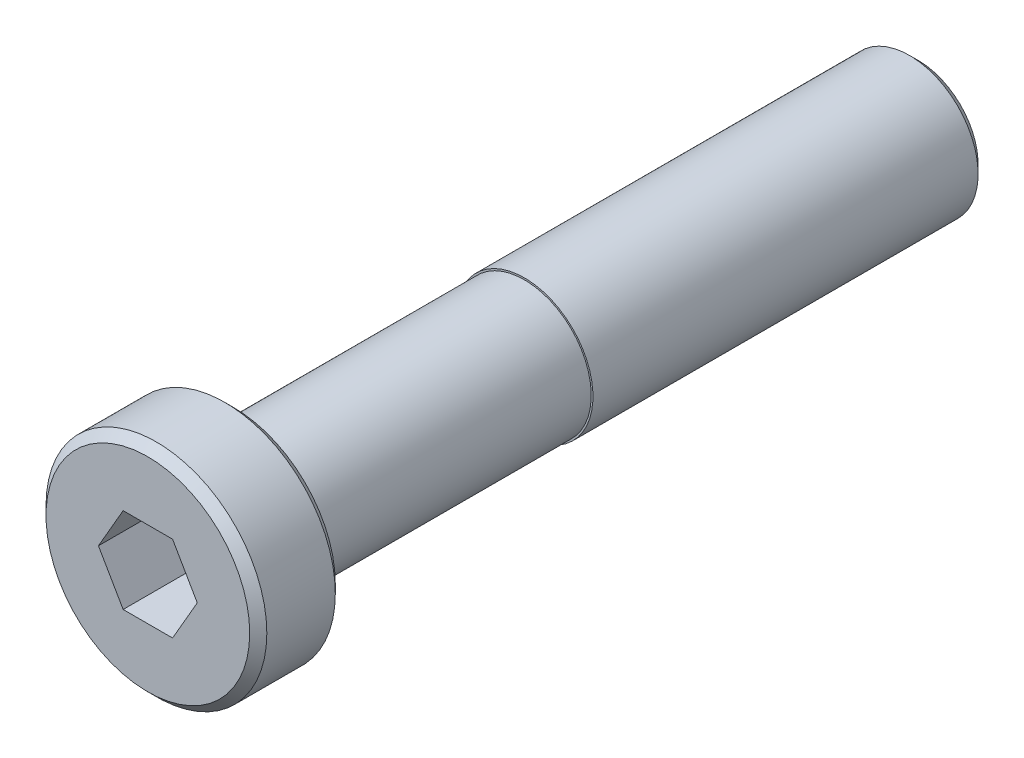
ISO-10303-21;
HEADER;
FILE_DESCRIPTION(('STEP AP214'),'2;1');
FILE_NAME('part.step','',(''),(''),'','','');
FILE_SCHEMA(('AUTOMOTIVE_DESIGN { 1 0 10303 214 1 1 1 1 }'));
ENDSEC;
DATA;
#1=APPLICATION_CONTEXT('core data for automotive mechanical design processes');
#2=APPLICATION_PROTOCOL_DEFINITION('international standard','automotive_design',2000,#1);
#3=PRODUCT_CONTEXT('',#1,'mechanical');
#4=PRODUCT('Part','Part','',(#3));
#5=PRODUCT_RELATED_PRODUCT_CATEGORY('part','',(#4));
#6=PRODUCT_DEFINITION_FORMATION('','',#4);
#7=PRODUCT_DEFINITION_CONTEXT('part definition',#1,'design');
#8=PRODUCT_DEFINITION('design','',#6,#7);
#9=PRODUCT_DEFINITION_SHAPE('','',#8);
#10=(LENGTH_UNIT() NAMED_UNIT(*) SI_UNIT(.MILLI.,.METRE.));
#11=(NAMED_UNIT(*) PLANE_ANGLE_UNIT() SI_UNIT($,.RADIAN.));
#12=(NAMED_UNIT(*) SI_UNIT($,.STERADIAN.) SOLID_ANGLE_UNIT());
#13=UNCERTAINTY_MEASURE_WITH_UNIT(LENGTH_MEASURE(1.E-05),#10,'distance_accuracy_value','');
#14=(GEOMETRIC_REPRESENTATION_CONTEXT(3) GLOBAL_UNCERTAINTY_ASSIGNED_CONTEXT((#13)) GLOBAL_UNIT_ASSIGNED_CONTEXT((#10,
#11,#12)) REPRESENTATION_CONTEXT('',''));
#15=CARTESIAN_POINT('',(0.,0.,0.));
#16=DIRECTION('',(0.,0.,1.));
#17=DIRECTION('',(1.,0.,0.));
#18=AXIS2_PLACEMENT_3D('',#15,#16,#17);
#19=CARTESIAN_POINT('',(0.,0.,-40.));
#20=DIRECTION('',(0.,0.,1.));
#21=DIRECTION('',(1.,0.,0.));
#22=AXIS2_PLACEMENT_3D('',#19,#20,#21);
#23=CYLINDRICAL_SURFACE('',#22,3.9);
#24=CARTESIAN_POINT('',(0.,0.,0.));
#25=DIRECTION('',(0.,0.,-1.));
#26=DIRECTION('',(-1.,0.,0.));
#27=AXIS2_PLACEMENT_3D('',#24,#25,#26);
#28=CIRCLE('',#27,3.9);
#29=CARTESIAN_POINT('',(-3.9,0.,0.));
#30=VERTEX_POINT('',#29);
#31=EDGE_CURVE('E176',#30,#30,#28,.T.);
#32=ORIENTED_EDGE('',*,*,#31,.T.);
#33=EDGE_LOOP('',(#32));
#34=FACE_BOUND('',#33,.T.);
#35=CARTESIAN_POINT('',(0.,0.,-17.));
#36=DIRECTION('',(0.,0.,-1.));
#37=DIRECTION('',(-1.,0.,0.));
#38=AXIS2_PLACEMENT_3D('',#35,#36,#37);
#39=CIRCLE('',#38,3.9);
#40=CARTESIAN_POINT('',(-3.9,0.,-17.));
#41=VERTEX_POINT('',#40);
#42=EDGE_CURVE('E201',#41,#41,#39,.T.);
#43=ORIENTED_EDGE('',*,*,#42,.F.);
#44=EDGE_LOOP('',(#43));
#45=FACE_BOUND('',#44,.T.);
#46=ADVANCED_FACE('F38',(#34,#45),#23,.T.);
#47=CARTESIAN_POINT('',(0.,0.,1.2));
#48=DIRECTION('',(0.,0.,1.));
#49=DIRECTION('',(1.,0.,0.));
#50=AXIS2_PLACEMENT_3D('',#47,#48,#49);
#51=PLANE('',#50);
#52=CARTESIAN_POINT('',(0.,0.,1.2));
#53=DIRECTION('',(0.,0.,1.));
#54=DIRECTION('',(1.,0.,0.));
#55=AXIS2_PLACEMENT_3D('',#52,#53,#54);
#56=CIRCLE('',#55,2.5);
#57=CARTESIAN_POINT('',(2.1650635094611,1.25,1.2));
#58=VERTEX_POINT('',#57);
#59=CARTESIAN_POINT('',(0.,2.5,1.2));
#60=VERTEX_POINT('',#59);
#61=EDGE_CURVE('E118',#58,#60,#56,.T.);
#62=ORIENTED_EDGE('',*,*,#61,.F.);
#63=DIRECTION('',(-0.5,0.866025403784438,0.));
#64=VECTOR('',#63,1.);
#65=CARTESIAN_POINT('',(2.88675134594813,0.,1.2));
#66=LINE('',#65,#64);
#67=CARTESIAN_POINT('',(1.44337567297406,2.5,1.2));
#68=VERTEX_POINT('',#67);
#69=EDGE_CURVE('E146',#58,#68,#66,.T.);
#70=ORIENTED_EDGE('',*,*,#69,.T.);
#71=DIRECTION('',(-1.,0.,0.));
#72=VECTOR('',#71,1.);
#73=CARTESIAN_POINT('',(1.44337567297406,2.5,1.2));
#74=LINE('',#73,#72);
#75=EDGE_CURVE('E140',#68,#60,#74,.T.);
#76=ORIENTED_EDGE('',*,*,#75,.T.);
#77=EDGE_LOOP('',(#62,#70,#76));
#78=FACE_BOUND('',#77,.T.);
#79=ADVANCED_FACE('F145',(#78),#51,.T.);
#80=CARTESIAN_POINT('',(-2.1650635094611,1.25,1.2));
#81=VERTEX_POINT('',#80);
#82=EDGE_CURVE('E120',#60,#81,#56,.T.);
#83=ORIENTED_EDGE('',*,*,#82,.F.);
#84=CARTESIAN_POINT('',(-1.44337567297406,2.5,1.2));
#85=VERTEX_POINT('',#84);
#86=EDGE_CURVE('E131',#60,#85,#74,.T.);
#87=ORIENTED_EDGE('',*,*,#86,.T.);
#88=DIRECTION('',(-0.5,-0.866025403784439,0.));
#89=VECTOR('',#88,1.);
#90=CARTESIAN_POINT('',(-1.44337567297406,2.5,1.2));
#91=LINE('',#90,#89);
#92=EDGE_CURVE('E134',#85,#81,#91,.T.);
#93=ORIENTED_EDGE('',*,*,#92,.T.);
#94=EDGE_LOOP('',(#83,#87,#93));
#95=FACE_BOUND('',#94,.T.);
#96=ADVANCED_FACE('F130',(#95),#51,.T.);
#97=CARTESIAN_POINT('',(-2.1650635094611,-1.25,1.2));
#98=VERTEX_POINT('',#97);
#99=EDGE_CURVE('E135',#81,#98,#56,.T.);
#100=ORIENTED_EDGE('',*,*,#99,.F.);
#101=CARTESIAN_POINT('',(-2.88675134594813,0.,1.2));
#102=VERTEX_POINT('',#101);
#103=EDGE_CURVE('E148',#81,#102,#91,.T.);
#104=ORIENTED_EDGE('',*,*,#103,.T.);
#105=DIRECTION('',(0.5,-0.866025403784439,0.));
#106=VECTOR('',#105,1.);
#107=CARTESIAN_POINT('',(-2.88675134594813,0.,1.2));
#108=LINE('',#107,#106);
#109=EDGE_CURVE('E154',#102,#98,#108,.T.);
#110=ORIENTED_EDGE('',*,*,#109,.T.);
#111=EDGE_LOOP('',(#100,#104,#110));
#112=FACE_BOUND('',#111,.T.);
#113=ADVANCED_FACE('F282',(#112),#51,.T.);
#114=CARTESIAN_POINT('',(0.,-2.5,1.2));
#115=VERTEX_POINT('',#114);
#116=EDGE_CURVE('E280',#98,#115,#56,.T.);
#117=ORIENTED_EDGE('',*,*,#116,.F.);
#118=CARTESIAN_POINT('',(-1.44337567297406,-2.5,1.2));
#119=VERTEX_POINT('',#118);
#120=EDGE_CURVE('E153',#98,#119,#108,.T.);
#121=ORIENTED_EDGE('',*,*,#120,.T.);
#122=DIRECTION('',(1.,0.,0.));
#123=VECTOR('',#122,1.);
#124=CARTESIAN_POINT('',(-1.44337567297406,-2.5,1.2));
#125=LINE('',#124,#123);
#126=EDGE_CURVE('E158',#119,#115,#125,.T.);
#127=ORIENTED_EDGE('',*,*,#126,.T.);
#128=EDGE_LOOP('',(#117,#121,#127));
#129=FACE_BOUND('',#128,.T.);
#130=ADVANCED_FACE('F279',(#129),#51,.T.);
#131=CARTESIAN_POINT('',(2.1650635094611,-1.25,1.2));
#132=VERTEX_POINT('',#131);
#133=EDGE_CURVE('E53',#115,#132,#56,.T.);
#134=ORIENTED_EDGE('',*,*,#133,.F.);
#135=CARTESIAN_POINT('',(1.44337567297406,-2.5,1.2));
#136=VERTEX_POINT('',#135);
#137=EDGE_CURVE('E157',#115,#136,#125,.T.);
#138=ORIENTED_EDGE('',*,*,#137,.T.);
#139=DIRECTION('',(0.5,0.866025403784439,0.));
#140=VECTOR('',#139,1.);
#141=CARTESIAN_POINT('',(1.44337567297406,-2.5,1.2));
#142=LINE('',#141,#140);
#143=EDGE_CURVE('E285',#136,#132,#142,.T.);
#144=ORIENTED_EDGE('',*,*,#143,.T.);
#145=EDGE_LOOP('',(#134,#138,#144));
#146=FACE_BOUND('',#145,.T.);
#147=ADVANCED_FACE('F238',(#146),#51,.T.);
#148=CARTESIAN_POINT('',(0.,0.,5.));
#149=DIRECTION('',(0.,0.,-1.));
#150=DIRECTION('',(-1.,0.,0.));
#151=AXIS2_PLACEMENT_3D('',#148,#149,#150);
#152=CYLINDRICAL_SURFACE('',#151,6.45);
#153=CARTESIAN_POINT('',(0.,0.,0.500000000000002));
#154=DIRECTION('',(0.,0.,1.));
#155=DIRECTION('',(1.,0.,0.));
#156=AXIS2_PLACEMENT_3D('',#153,#154,#155);
#157=CIRCLE('',#156,6.45);
#158=CARTESIAN_POINT('',(6.45,0.,0.500000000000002));
#159=VERTEX_POINT('',#158);
#160=EDGE_CURVE('E192',#159,#159,#157,.T.);
#161=ORIENTED_EDGE('',*,*,#160,.T.);
#162=EDGE_LOOP('',(#161));
#163=FACE_BOUND('',#162,.T.);
#164=CARTESIAN_POINT('',(0.,0.,4.5));
#165=DIRECTION('',(0.,0.,1.));
#166=DIRECTION('',(1.,0.,0.));
#167=AXIS2_PLACEMENT_3D('',#164,#165,#166);
#168=CIRCLE('',#167,6.45);
#169=CARTESIAN_POINT('',(6.45,0.,4.5));
#170=VERTEX_POINT('',#169);
#171=EDGE_CURVE('E189',#170,#170,#168,.F.);
#172=ORIENTED_EDGE('',*,*,#171,.T.);
#173=EDGE_LOOP('',(#172));
#174=FACE_BOUND('',#173,.T.);
#175=ADVANCED_FACE('F230',(#163,#174),#152,.T.);
#176=CARTESIAN_POINT('',(0.,0.,5.));
#177=DIRECTION('',(0.,0.,1.));
#178=DIRECTION('',(1.,0.,0.));
#179=AXIS2_PLACEMENT_3D('',#176,#177,#178);
#180=PLANE('',#179);
#181=CARTESIAN_POINT('',(0.,0.,5.));
#182=DIRECTION('',(0.,0.,1.));
#183=DIRECTION('',(1.,0.,0.));
#184=AXIS2_PLACEMENT_3D('',#181,#182,#183);
#185=CIRCLE('',#184,5.95);
#186=CARTESIAN_POINT('',(5.95,0.,5.));
#187=VERTEX_POINT('',#186);
#188=EDGE_CURVE('E198',#187,#187,#185,.T.);
#189=ORIENTED_EDGE('',*,*,#188,.T.);
#190=EDGE_LOOP('',(#189));
#191=FACE_BOUND('',#190,.T.);
#192=DIRECTION('',(0.5,0.866025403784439,0.));
#193=VECTOR('',#192,1.);
#194=CARTESIAN_POINT('',(1.44337567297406,-2.5,5.));
#195=LINE('',#194,#193);
#196=CARTESIAN_POINT('',(1.44337567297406,-2.5,5.));
#197=VERTEX_POINT('',#196);
#198=CARTESIAN_POINT('',(2.88675134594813,0.,5.));
#199=VERTEX_POINT('',#198);
#200=EDGE_CURVE('E61',#197,#199,#195,.T.);
#201=ORIENTED_EDGE('',*,*,#200,.F.);
#202=DIRECTION('',(1.,0.,0.));
#203=VECTOR('',#202,1.);
#204=CARTESIAN_POINT('',(-1.44337567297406,-2.5,5.));
#205=LINE('',#204,#203);
#206=CARTESIAN_POINT('',(-1.44337567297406,-2.5,5.));
#207=VERTEX_POINT('',#206);
#208=EDGE_CURVE('E171',#207,#197,#205,.T.);
#209=ORIENTED_EDGE('',*,*,#208,.F.);
#210=DIRECTION('',(0.5,-0.866025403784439,0.));
#211=VECTOR('',#210,1.);
#212=CARTESIAN_POINT('',(-2.88675134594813,0.,5.));
#213=LINE('',#212,#211);
#214=CARTESIAN_POINT('',(-2.88675134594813,0.,5.));
#215=VERTEX_POINT('',#214);
#216=EDGE_CURVE('E169',#215,#207,#213,.T.);
#217=ORIENTED_EDGE('',*,*,#216,.F.);
#218=DIRECTION('',(-0.5,-0.866025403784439,0.));
#219=VECTOR('',#218,1.);
#220=CARTESIAN_POINT('',(-1.44337567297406,2.5,5.));
#221=LINE('',#220,#219);
#222=CARTESIAN_POINT('',(-1.44337567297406,2.5,5.));
#223=VERTEX_POINT('',#222);
#224=EDGE_CURVE('E167',#223,#215,#221,.T.);
#225=ORIENTED_EDGE('',*,*,#224,.F.);
#226=DIRECTION('',(-1.,0.,0.));
#227=VECTOR('',#226,1.);
#228=CARTESIAN_POINT('',(1.44337567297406,2.5,5.));
#229=LINE('',#228,#227);
#230=CARTESIAN_POINT('',(1.44337567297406,2.5,5.));
#231=VERTEX_POINT('',#230);
#232=EDGE_CURVE('E165',#231,#223,#229,.T.);
#233=ORIENTED_EDGE('',*,*,#232,.F.);
#234=DIRECTION('',(-0.5,0.866025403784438,0.));
#235=VECTOR('',#234,1.);
#236=CARTESIAN_POINT('',(2.88675134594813,0.,5.));
#237=LINE('',#236,#235);
#238=EDGE_CURVE('E163',#199,#231,#237,.T.);
#239=ORIENTED_EDGE('',*,*,#238,.F.);
#240=EDGE_LOOP('',(#201,#209,#217,#225,#233,#239));
#241=FACE_BOUND('',#240,.T.);
#242=ADVANCED_FACE('F226',(#191,#241),#180,.T.);
#243=CARTESIAN_POINT('',(0.,0.,0.));
#244=DIRECTION('',(0.,0.,1.));
#245=DIRECTION('',(1.,0.,0.));
#246=AXIS2_PLACEMENT_3D('',#243,#244,#245);
#247=PLANE('',#246);
#248=CARTESIAN_POINT('',(0.,0.,0.));
#249=DIRECTION('',(0.,0.,1.));
#250=DIRECTION('',(1.,0.,0.));
#251=AXIS2_PLACEMENT_3D('',#248,#249,#250);
#252=CIRCLE('',#251,5.95);
#253=CARTESIAN_POINT('',(5.95,0.,0.));
#254=VERTEX_POINT('',#253);
#255=EDGE_CURVE('E195',#254,#254,#252,.F.);
#256=ORIENTED_EDGE('',*,*,#255,.T.);
#257=EDGE_LOOP('',(#256));
#258=FACE_BOUND('',#257,.T.);
#259=ORIENTED_EDGE('',*,*,#31,.F.);
#260=EDGE_LOOP('',(#259));
#261=FACE_BOUND('',#260,.T.);
#262=ADVANCED_FACE('F229',(#258,#261),#247,.F.);
#263=CARTESIAN_POINT('',(1.44337567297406,-2.5,1.2));
#264=DIRECTION('',(0.866025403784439,-0.5,0.));
#265=DIRECTION('',(0.5,0.866025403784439,0.));
#266=AXIS2_PLACEMENT_3D('',#263,#264,#265);
#267=PLANE('',#266);
#268=CARTESIAN_POINT('',(2.88675134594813,0.,1.2));
#269=VERTEX_POINT('',#268);
#270=EDGE_CURVE('E173',#132,#269,#142,.T.);
#271=ORIENTED_EDGE('',*,*,#270,.F.);
#272=ORIENTED_EDGE('',*,*,#143,.F.);
#273=DIRECTION('',(0.,0.,1.));
#274=VECTOR('',#273,1.);
#275=CARTESIAN_POINT('',(1.44337567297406,-2.5,1.2));
#276=LINE('',#275,#274);
#277=EDGE_CURVE('E174',#136,#197,#276,.T.);
#278=ORIENTED_EDGE('',*,*,#277,.T.);
#279=ORIENTED_EDGE('',*,*,#200,.T.);
#280=DIRECTION('',(0.,0.,1.));
#281=VECTOR('',#280,1.);
#282=CARTESIAN_POINT('',(2.88675134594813,0.,1.2));
#283=LINE('',#282,#281);
#284=EDGE_CURVE('E161',#269,#199,#283,.T.);
#285=ORIENTED_EDGE('',*,*,#284,.F.);
#286=EDGE_LOOP('',(#271,#272,#278,#279,#285));
#287=FACE_BOUND('',#286,.T.);
#288=ADVANCED_FACE('F234',(#287),#267,.F.);
#289=CARTESIAN_POINT('',(-1.44337567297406,-2.5,1.2));
#290=DIRECTION('',(0.,-1.,0.));
#291=DIRECTION('',(0.,0.,-1.));
#292=AXIS2_PLACEMENT_3D('',#289,#290,#291);
#293=PLANE('',#292);
#294=ORIENTED_EDGE('',*,*,#137,.F.);
#295=ORIENTED_EDGE('',*,*,#126,.F.);
#296=DIRECTION('',(0.,0.,1.));
#297=VECTOR('',#296,1.);
#298=CARTESIAN_POINT('',(-1.44337567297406,-2.5,1.2));
#299=LINE('',#298,#297);
#300=EDGE_CURVE('E177',#119,#207,#299,.T.);
#301=ORIENTED_EDGE('',*,*,#300,.T.);
#302=ORIENTED_EDGE('',*,*,#208,.T.);
#303=ORIENTED_EDGE('',*,*,#277,.F.);
#304=EDGE_LOOP('',(#294,#295,#301,#302,#303));
#305=FACE_BOUND('',#304,.T.);
#306=ADVANCED_FACE('F275',(#305),#293,.F.);
#307=CARTESIAN_POINT('',(-2.88675134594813,0.,1.2));
#308=DIRECTION('',(-0.866025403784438,-0.5,0.));
#309=DIRECTION('',(0.5,-0.866025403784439,0.));
#310=AXIS2_PLACEMENT_3D('',#307,#308,#309);
#311=PLANE('',#310);
#312=ORIENTED_EDGE('',*,*,#120,.F.);
#313=ORIENTED_EDGE('',*,*,#109,.F.);
#314=DIRECTION('',(0.,0.,1.));
#315=VECTOR('',#314,1.);
#316=CARTESIAN_POINT('',(-2.88675134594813,0.,1.2));
#317=LINE('',#316,#315);
#318=EDGE_CURVE('E180',#102,#215,#317,.T.);
#319=ORIENTED_EDGE('',*,*,#318,.T.);
#320=ORIENTED_EDGE('',*,*,#216,.T.);
#321=ORIENTED_EDGE('',*,*,#300,.F.);
#322=EDGE_LOOP('',(#312,#313,#319,#320,#321));
#323=FACE_BOUND('',#322,.T.);
#324=ADVANCED_FACE('F270',(#323),#311,.F.);
#325=CARTESIAN_POINT('',(-1.44337567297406,2.5,1.2));
#326=DIRECTION('',(-0.866025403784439,0.5,0.));
#327=DIRECTION('',(-0.5,-0.866025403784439,0.));
#328=AXIS2_PLACEMENT_3D('',#325,#326,#327);
#329=PLANE('',#328);
#330=ORIENTED_EDGE('',*,*,#103,.F.);
#331=ORIENTED_EDGE('',*,*,#92,.F.);
#332=DIRECTION('',(0.,0.,1.));
#333=VECTOR('',#332,1.);
#334=CARTESIAN_POINT('',(-1.44337567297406,2.5,1.2));
#335=LINE('',#334,#333);
#336=EDGE_CURVE('E142',#85,#223,#335,.T.);
#337=ORIENTED_EDGE('',*,*,#336,.T.);
#338=ORIENTED_EDGE('',*,*,#224,.T.);
#339=ORIENTED_EDGE('',*,*,#318,.F.);
#340=EDGE_LOOP('',(#330,#331,#337,#338,#339));
#341=FACE_BOUND('',#340,.T.);
#342=ADVANCED_FACE('F265',(#341),#329,.F.);
#343=CARTESIAN_POINT('',(1.44337567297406,2.5,1.2));
#344=DIRECTION('',(0.,1.,0.));
#345=DIRECTION('',(0.,0.,1.));
#346=AXIS2_PLACEMENT_3D('',#343,#344,#345);
#347=PLANE('',#346);
#348=ORIENTED_EDGE('',*,*,#86,.F.);
#349=ORIENTED_EDGE('',*,*,#75,.F.);
#350=DIRECTION('',(0.,0.,1.));
#351=VECTOR('',#350,1.);
#352=CARTESIAN_POINT('',(1.44337567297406,2.5,1.2));
#353=LINE('',#352,#351);
#354=EDGE_CURVE('E184',#68,#231,#353,.T.);
#355=ORIENTED_EDGE('',*,*,#354,.T.);
#356=ORIENTED_EDGE('',*,*,#232,.T.);
#357=ORIENTED_EDGE('',*,*,#336,.F.);
#358=EDGE_LOOP('',(#348,#349,#355,#356,#357));
#359=FACE_BOUND('',#358,.T.);
#360=ADVANCED_FACE('F138',(#359),#347,.F.);
#361=CARTESIAN_POINT('',(2.88675134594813,0.,1.2));
#362=DIRECTION('',(0.866025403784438,0.5,0.));
#363=DIRECTION('',(-0.5,0.866025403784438,0.));
#364=AXIS2_PLACEMENT_3D('',#361,#362,#363);
#365=PLANE('',#364);
#366=ORIENTED_EDGE('',*,*,#69,.F.);
#367=EDGE_CURVE('E143',#269,#58,#66,.T.);
#368=ORIENTED_EDGE('',*,*,#367,.F.);
#369=ORIENTED_EDGE('',*,*,#284,.T.);
#370=ORIENTED_EDGE('',*,*,#238,.T.);
#371=ORIENTED_EDGE('',*,*,#354,.F.);
#372=EDGE_LOOP('',(#366,#368,#369,#370,#371));
#373=FACE_BOUND('',#372,.T.);
#374=ADVANCED_FACE('F261',(#373),#365,.F.);
#375=EDGE_CURVE('E122',#132,#58,#56,.T.);
#376=ORIENTED_EDGE('',*,*,#375,.F.);
#377=ORIENTED_EDGE('',*,*,#270,.T.);
#378=ORIENTED_EDGE('',*,*,#367,.T.);
#379=EDGE_LOOP('',(#376,#377,#378));
#380=FACE_BOUND('',#379,.T.);
#381=ADVANCED_FACE('F115',(#380),#51,.T.);
#382=CARTESIAN_POINT('',(0.,0.,1.2));
#383=DIRECTION('',(0.,0.,1.));
#384=DIRECTION('',(1.,0.,0.));
#385=AXIS2_PLACEMENT_3D('',#382,#383,#384);
#386=CONICAL_SURFACE('',#385,2.5,1.02974425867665);
#387=CARTESIAN_POINT('',(0.,0.,-0.3021515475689));
#388=VERTEX_POINT('',#387);
#389=VERTEX_LOOP('',#388);
#390=FACE_BOUND('',#389,.T.);
#391=ORIENTED_EDGE('',*,*,#61,.T.);
#392=ORIENTED_EDGE('',*,*,#82,.T.);
#393=ORIENTED_EDGE('',*,*,#99,.T.);
#394=ORIENTED_EDGE('',*,*,#116,.T.);
#395=ORIENTED_EDGE('',*,*,#133,.T.);
#396=ORIENTED_EDGE('',*,*,#375,.T.);
#397=EDGE_LOOP('',(#391,#392,#393,#394,#395,#396));
#398=FACE_BOUND('',#397,.T.);
#399=ADVANCED_FACE('F112',(#390,#398),#386,.F.);
#400=CARTESIAN_POINT('',(0.,0.,0.500000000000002));
#401=DIRECTION('',(0.,0.,1.));
#402=DIRECTION('',(1.,0.,0.));
#403=AXIS2_PLACEMENT_3D('',#400,#401,#402);
#404=CONICAL_SURFACE('',#403,6.45,0.78539816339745);
#405=ORIENTED_EDGE('',*,*,#255,.F.);
#406=EDGE_LOOP('',(#405));
#407=FACE_BOUND('',#406,.T.);
#408=ORIENTED_EDGE('',*,*,#160,.F.);
#409=EDGE_LOOP('',(#408));
#410=FACE_BOUND('',#409,.T.);
#411=ADVANCED_FACE('F114',(#407,#410),#404,.T.);
#412=CARTESIAN_POINT('',(0.,0.,5.));
#413=DIRECTION('',(0.,0.,-1.));
#414=DIRECTION('',(-1.,0.,0.));
#415=AXIS2_PLACEMENT_3D('',#412,#413,#414);
#416=CONICAL_SURFACE('',#415,5.95,0.785398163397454);
#417=ORIENTED_EDGE('',*,*,#171,.F.);
#418=EDGE_LOOP('',(#417));
#419=FACE_BOUND('',#418,.T.);
#420=ORIENTED_EDGE('',*,*,#188,.F.);
#421=EDGE_LOOP('',(#420));
#422=FACE_BOUND('',#421,.T.);
#423=ADVANCED_FACE('F241',(#419,#422),#416,.T.);
#424=CARTESIAN_POINT('',(0.,0.,-17.));
#425=DIRECTION('',(0.,0.,-1.));
#426=DIRECTION('',(-1.,0.,0.));
#427=AXIS2_PLACEMENT_3D('',#424,#425,#426);
#428=CYLINDRICAL_SURFACE('',#427,4.);
#429=CARTESIAN_POINT('',(0.,0.,-39.5));
#430=DIRECTION('',(0.,0.,-1.));
#431=DIRECTION('',(-1.,0.,0.));
#432=AXIS2_PLACEMENT_3D('',#429,#430,#431);
#433=CIRCLE('',#432,4.);
#434=CARTESIAN_POINT('',(-4.,0.,-39.5));
#435=VERTEX_POINT('',#434);
#436=EDGE_CURVE('E11',#435,#435,#433,.F.);
#437=ORIENTED_EDGE('',*,*,#436,.T.);
#438=EDGE_LOOP('',(#437));
#439=FACE_BOUND('',#438,.T.);
#440=CARTESIAN_POINT('',(0.,0.,-17.));
#441=DIRECTION('',(0.,0.,-1.));
#442=DIRECTION('',(-1.,0.,0.));
#443=AXIS2_PLACEMENT_3D('',#440,#441,#442);
#444=CIRCLE('',#443,4.);
#445=CARTESIAN_POINT('',(-4.,0.,-17.));
#446=VERTEX_POINT('',#445);
#447=EDGE_CURVE('E284',#446,#446,#444,.T.);
#448=ORIENTED_EDGE('',*,*,#447,.T.);
#449=EDGE_LOOP('',(#448));
#450=FACE_BOUND('',#449,.T.);
#451=ADVANCED_FACE('F244',(#439,#450),#428,.T.);
#452=CARTESIAN_POINT('',(0.,0.,-17.));
#453=DIRECTION('',(0.,0.,-1.));
#454=DIRECTION('',(-1.,0.,0.));
#455=AXIS2_PLACEMENT_3D('',#452,#453,#454);
#456=PLANE('',#455);
#457=ORIENTED_EDGE('',*,*,#42,.T.);
#458=EDGE_LOOP('',(#457));
#459=FACE_BOUND('',#458,.T.);
#460=ORIENTED_EDGE('',*,*,#447,.F.);
#461=EDGE_LOOP('',(#460));
#462=FACE_BOUND('',#461,.T.);
#463=ADVANCED_FACE('F213',(#459,#462),#456,.F.);
#464=CARTESIAN_POINT('',(0.,0.,-40.));
#465=DIRECTION('',(0.,0.,-1.));
#466=DIRECTION('',(-1.,0.,0.));
#467=AXIS2_PLACEMENT_3D('',#464,#465,#466);
#468=PLANE('',#467);
#469=CARTESIAN_POINT('',(0.,0.,-40.));
#470=DIRECTION('',(0.,0.,-1.));
#471=DIRECTION('',(-1.,0.,0.));
#472=AXIS2_PLACEMENT_3D('',#469,#470,#471);
#473=CIRCLE('',#472,3.5);
#474=CARTESIAN_POINT('',(-3.5,0.,-40.));
#475=VERTEX_POINT('',#474);
#476=EDGE_CURVE('E46',#475,#475,#473,.T.);
#477=ORIENTED_EDGE('',*,*,#476,.T.);
#478=EDGE_LOOP('',(#477));
#479=FACE_BOUND('',#478,.T.);
#480=ADVANCED_FACE('F206',(#479),#468,.T.);
#481=CARTESIAN_POINT('',(0.,0.,-40.));
#482=DIRECTION('',(0.,0.,1.));
#483=DIRECTION('',(1.,0.,0.));
#484=AXIS2_PLACEMENT_3D('',#481,#482,#483);
#485=CONICAL_SURFACE('',#484,3.5,0.785398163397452);
#486=ORIENTED_EDGE('',*,*,#436,.F.);
#487=EDGE_LOOP('',(#486));
#488=FACE_BOUND('',#487,.T.);
#489=ORIENTED_EDGE('',*,*,#476,.F.);
#490=EDGE_LOOP('',(#489));
#491=FACE_BOUND('',#490,.T.);
#492=ADVANCED_FACE('F40',(#488,#491),#485,.T.);
#493=CLOSED_SHELL('',(#46,#79,#96,#113,#130,#147,#175,#242,#262,#288,#306,#324,#342,#360,#374,
#381,#399,#411,#423,#451,#463,#480,#492));
#494=MANIFOLD_SOLID_BREP('B2',#493);
#495=ADVANCED_BREP_SHAPE_REPRESENTATION('',(#18,#494),#14);
#496=SHAPE_DEFINITION_REPRESENTATION(#9,#495);
ENDSEC;
END-ISO-10303-21;
